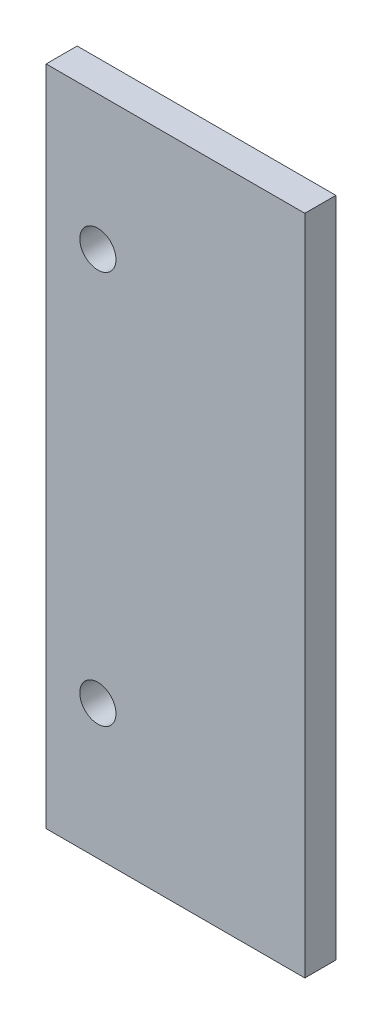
ISO-10303-21;
HEADER;
FILE_DESCRIPTION(('STEP AP214'),'2;1');
FILE_NAME('part.step','',(''),(''),'','','');
FILE_SCHEMA(('AUTOMOTIVE_DESIGN { 1 0 10303 214 1 1 1 1 }'));
ENDSEC;
DATA;
#1=APPLICATION_CONTEXT('core data for automotive mechanical design processes');
#2=APPLICATION_PROTOCOL_DEFINITION('international standard','automotive_design',2000,#1);
#3=PRODUCT_CONTEXT('',#1,'mechanical');
#4=PRODUCT('Part','Part','',(#3));
#5=PRODUCT_RELATED_PRODUCT_CATEGORY('part','',(#4));
#6=PRODUCT_DEFINITION_FORMATION('','',#4);
#7=PRODUCT_DEFINITION_CONTEXT('part definition',#1,'design');
#8=PRODUCT_DEFINITION('design','',#6,#7);
#9=PRODUCT_DEFINITION_SHAPE('','',#8);
#10=(LENGTH_UNIT() NAMED_UNIT(*) SI_UNIT(.MILLI.,.METRE.));
#11=(NAMED_UNIT(*) PLANE_ANGLE_UNIT() SI_UNIT($,.RADIAN.));
#12=(NAMED_UNIT(*) SI_UNIT($,.STERADIAN.) SOLID_ANGLE_UNIT());
#13=UNCERTAINTY_MEASURE_WITH_UNIT(LENGTH_MEASURE(1.E-05),#10,'distance_accuracy_value','');
#14=(GEOMETRIC_REPRESENTATION_CONTEXT(3) GLOBAL_UNCERTAINTY_ASSIGNED_CONTEXT((#13)) GLOBAL_UNIT_ASSIGNED_CONTEXT((#10,
#11,#12)) REPRESENTATION_CONTEXT('',''));
#15=CARTESIAN_POINT('',(0.,0.,0.));
#16=DIRECTION('',(0.,0.,1.));
#17=DIRECTION('',(1.,0.,0.));
#18=AXIS2_PLACEMENT_3D('',#15,#16,#17);
#19=CARTESIAN_POINT('',(0.,64.,3.));
#20=DIRECTION('',(0.,0.,-1.));
#21=DIRECTION('',(-1.,0.,0.));
#22=AXIS2_PLACEMENT_3D('',#19,#20,#21);
#23=PLANE('',#22);
#24=CARTESIAN_POINT('',(5.,51.,3.));
#25=DIRECTION('',(0.,0.,1.));
#26=DIRECTION('',(1.,0.,0.));
#27=AXIS2_PLACEMENT_3D('',#24,#25,#26);
#28=CIRCLE('',#27,1.75);
#29=CARTESIAN_POINT('',(6.75,51.,3.));
#30=VERTEX_POINT('',#29);
#31=EDGE_CURVE('E98',#30,#30,#28,.T.);
#32=ORIENTED_EDGE('',*,*,#31,.F.);
#33=EDGE_LOOP('',(#32));
#34=FACE_BOUND('',#33,.T.);
#35=DIRECTION('',(0.,-1.,0.));
#36=VECTOR('',#35,1.);
#37=CARTESIAN_POINT('',(0.,0.,3.));
#38=LINE('',#37,#36);
#39=CARTESIAN_POINT('',(0.,64.,3.));
#40=VERTEX_POINT('',#39);
#41=CARTESIAN_POINT('',(0.,0.,3.));
#42=VERTEX_POINT('',#41);
#43=EDGE_CURVE('E83',#40,#42,#38,.T.);
#44=ORIENTED_EDGE('',*,*,#43,.T.);
#45=DIRECTION('',(1.,0.,0.));
#46=VECTOR('',#45,1.);
#47=CARTESIAN_POINT('',(0.,0.,3.));
#48=LINE('',#47,#46);
#49=CARTESIAN_POINT('',(25.,0.,3.));
#50=VERTEX_POINT('',#49);
#51=EDGE_CURVE('E78',#42,#50,#48,.T.);
#52=ORIENTED_EDGE('',*,*,#51,.T.);
#53=DIRECTION('',(0.,1.,0.));
#54=VECTOR('',#53,1.);
#55=CARTESIAN_POINT('',(25.,0.,3.));
#56=LINE('',#55,#54);
#57=CARTESIAN_POINT('',(25.,64.,3.));
#58=VERTEX_POINT('',#57);
#59=EDGE_CURVE('E81',#50,#58,#56,.T.);
#60=ORIENTED_EDGE('',*,*,#59,.T.);
#61=DIRECTION('',(-1.,0.,0.));
#62=VECTOR('',#61,1.);
#63=CARTESIAN_POINT('',(0.,64.,3.));
#64=LINE('',#63,#62);
#65=EDGE_CURVE('E48',#58,#40,#64,.T.);
#66=ORIENTED_EDGE('',*,*,#65,.T.);
#67=EDGE_LOOP('',(#44,#52,#60,#66));
#68=FACE_BOUND('',#67,.T.);
#69=CARTESIAN_POINT('',(5.,13.,3.));
#70=DIRECTION('',(0.,0.,1.));
#71=DIRECTION('',(1.,0.,0.));
#72=AXIS2_PLACEMENT_3D('',#69,#70,#71);
#73=CIRCLE('',#72,1.75);
#74=CARTESIAN_POINT('',(6.75000000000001,13.,3.));
#75=VERTEX_POINT('',#74);
#76=EDGE_CURVE('E113',#75,#75,#73,.T.);
#77=ORIENTED_EDGE('',*,*,#76,.F.);
#78=EDGE_LOOP('',(#77));
#79=FACE_BOUND('',#78,.T.);
#80=ADVANCED_FACE('F31',(#34,#68,#79),#23,.F.);
#81=CARTESIAN_POINT('',(0.,64.,0.));
#82=DIRECTION('',(0.,0.,-1.));
#83=DIRECTION('',(-1.,0.,0.));
#84=AXIS2_PLACEMENT_3D('',#81,#82,#83);
#85=PLANE('',#84);
#86=CARTESIAN_POINT('',(5.,51.,0.));
#87=DIRECTION('',(0.,0.,1.));
#88=DIRECTION('',(1.,0.,0.));
#89=AXIS2_PLACEMENT_3D('',#86,#87,#88);
#90=CIRCLE('',#89,1.75);
#91=CARTESIAN_POINT('',(6.75,51.,0.));
#92=VERTEX_POINT('',#91);
#93=EDGE_CURVE('E110',#92,#92,#90,.T.);
#94=ORIENTED_EDGE('',*,*,#93,.T.);
#95=EDGE_LOOP('',(#94));
#96=FACE_BOUND('',#95,.T.);
#97=DIRECTION('',(0.,-1.,0.));
#98=VECTOR('',#97,1.);
#99=CARTESIAN_POINT('',(0.,0.,0.));
#100=LINE('',#99,#98);
#101=CARTESIAN_POINT('',(0.,64.,0.));
#102=VERTEX_POINT('',#101);
#103=CARTESIAN_POINT('',(0.,0.,0.));
#104=VERTEX_POINT('',#103);
#105=EDGE_CURVE('E95',#102,#104,#100,.T.);
#106=ORIENTED_EDGE('',*,*,#105,.F.);
#107=DIRECTION('',(-1.,0.,0.));
#108=VECTOR('',#107,1.);
#109=CARTESIAN_POINT('',(0.,64.,0.));
#110=LINE('',#109,#108);
#111=CARTESIAN_POINT('',(25.,64.,0.));
#112=VERTEX_POINT('',#111);
#113=EDGE_CURVE('E71',#112,#102,#110,.T.);
#114=ORIENTED_EDGE('',*,*,#113,.F.);
#115=DIRECTION('',(0.,1.,0.));
#116=VECTOR('',#115,1.);
#117=CARTESIAN_POINT('',(25.,0.,0.));
#118=LINE('',#117,#116);
#119=CARTESIAN_POINT('',(25.,0.,0.));
#120=VERTEX_POINT('',#119);
#121=EDGE_CURVE('E65',#120,#112,#118,.T.);
#122=ORIENTED_EDGE('',*,*,#121,.F.);
#123=DIRECTION('',(1.,0.,0.));
#124=VECTOR('',#123,1.);
#125=CARTESIAN_POINT('',(0.,0.,0.));
#126=LINE('',#125,#124);
#127=EDGE_CURVE('E87',#104,#120,#126,.T.);
#128=ORIENTED_EDGE('',*,*,#127,.F.);
#129=EDGE_LOOP('',(#106,#114,#122,#128));
#130=FACE_BOUND('',#129,.T.);
#131=CARTESIAN_POINT('',(5.,13.,0.));
#132=DIRECTION('',(0.,0.,1.));
#133=DIRECTION('',(1.,0.,0.));
#134=AXIS2_PLACEMENT_3D('',#131,#132,#133);
#135=CIRCLE('',#134,1.75);
#136=CARTESIAN_POINT('',(6.75000000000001,13.,0.));
#137=VERTEX_POINT('',#136);
#138=EDGE_CURVE('E116',#137,#137,#135,.T.);
#139=ORIENTED_EDGE('',*,*,#138,.T.);
#140=EDGE_LOOP('',(#139));
#141=FACE_BOUND('',#140,.T.);
#142=ADVANCED_FACE('F106',(#96,#130,#141),#85,.T.);
#143=CARTESIAN_POINT('',(0.,0.,3.));
#144=DIRECTION('',(1.,0.,0.));
#145=DIRECTION('',(0.,0.,-1.));
#146=AXIS2_PLACEMENT_3D('',#143,#144,#145);
#147=PLANE('',#146);
#148=ORIENTED_EDGE('',*,*,#105,.T.);
#149=DIRECTION('',(0.,0.,-1.));
#150=VECTOR('',#149,1.);
#151=CARTESIAN_POINT('',(0.,0.,3.));
#152=LINE('',#151,#150);
#153=EDGE_CURVE('E11',#42,#104,#152,.T.);
#154=ORIENTED_EDGE('',*,*,#153,.F.);
#155=ORIENTED_EDGE('',*,*,#43,.F.);
#156=DIRECTION('',(0.,0.,-1.));
#157=VECTOR('',#156,1.);
#158=CARTESIAN_POINT('',(0.,64.,3.));
#159=LINE('',#158,#157);
#160=EDGE_CURVE('E91',#40,#102,#159,.T.);
#161=ORIENTED_EDGE('',*,*,#160,.T.);
#162=EDGE_LOOP('',(#148,#154,#155,#161));
#163=FACE_BOUND('',#162,.T.);
#164=ADVANCED_FACE('F33',(#163),#147,.F.);
#165=CARTESIAN_POINT('',(0.,0.,3.));
#166=DIRECTION('',(0.,1.,0.));
#167=DIRECTION('',(0.,0.,1.));
#168=AXIS2_PLACEMENT_3D('',#165,#166,#167);
#169=PLANE('',#168);
#170=ORIENTED_EDGE('',*,*,#127,.T.);
#171=DIRECTION('',(0.,0.,-1.));
#172=VECTOR('',#171,1.);
#173=CARTESIAN_POINT('',(25.,0.,3.));
#174=LINE('',#173,#172);
#175=EDGE_CURVE('E40',#50,#120,#174,.T.);
#176=ORIENTED_EDGE('',*,*,#175,.F.);
#177=ORIENTED_EDGE('',*,*,#51,.F.);
#178=ORIENTED_EDGE('',*,*,#153,.T.);
#179=EDGE_LOOP('',(#170,#176,#177,#178));
#180=FACE_BOUND('',#179,.T.);
#181=ADVANCED_FACE('F86',(#180),#169,.F.);
#182=CARTESIAN_POINT('',(25.,0.,3.));
#183=DIRECTION('',(-1.,0.,0.));
#184=DIRECTION('',(0.,-1.,0.));
#185=AXIS2_PLACEMENT_3D('',#182,#183,#184);
#186=PLANE('',#185);
#187=ORIENTED_EDGE('',*,*,#121,.T.);
#188=DIRECTION('',(0.,0.,-1.));
#189=VECTOR('',#188,1.);
#190=CARTESIAN_POINT('',(25.,64.,3.));
#191=LINE('',#190,#189);
#192=EDGE_CURVE('E88',#58,#112,#191,.T.);
#193=ORIENTED_EDGE('',*,*,#192,.F.);
#194=ORIENTED_EDGE('',*,*,#59,.F.);
#195=ORIENTED_EDGE('',*,*,#175,.T.);
#196=EDGE_LOOP('',(#187,#193,#194,#195));
#197=FACE_BOUND('',#196,.T.);
#198=ADVANCED_FACE('F89',(#197),#186,.F.);
#199=CARTESIAN_POINT('',(0.,64.,3.));
#200=DIRECTION('',(0.,-1.,0.));
#201=DIRECTION('',(0.,0.,-1.));
#202=AXIS2_PLACEMENT_3D('',#199,#200,#201);
#203=PLANE('',#202);
#204=ORIENTED_EDGE('',*,*,#113,.T.);
#205=ORIENTED_EDGE('',*,*,#160,.F.);
#206=ORIENTED_EDGE('',*,*,#65,.F.);
#207=ORIENTED_EDGE('',*,*,#192,.T.);
#208=EDGE_LOOP('',(#204,#205,#206,#207));
#209=FACE_BOUND('',#208,.T.);
#210=ADVANCED_FACE('F103',(#209),#203,.F.);
#211=CARTESIAN_POINT('',(5.,51.,3.));
#212=DIRECTION('',(0.,0.,-1.));
#213=DIRECTION('',(-1.,0.,0.));
#214=AXIS2_PLACEMENT_3D('',#211,#212,#213);
#215=CYLINDRICAL_SURFACE('',#214,1.75);
#216=ORIENTED_EDGE('',*,*,#31,.T.);
#217=EDGE_LOOP('',(#216));
#218=FACE_BOUND('',#217,.T.);
#219=ORIENTED_EDGE('',*,*,#93,.F.);
#220=EDGE_LOOP('',(#219));
#221=FACE_BOUND('',#220,.T.);
#222=ADVANCED_FACE('F134',(#218,#221),#215,.F.);
#223=CARTESIAN_POINT('',(5.,13.,3.));
#224=DIRECTION('',(0.,0.,-1.));
#225=DIRECTION('',(-1.,0.,0.));
#226=AXIS2_PLACEMENT_3D('',#223,#224,#225);
#227=CYLINDRICAL_SURFACE('',#226,1.75);
#228=ORIENTED_EDGE('',*,*,#76,.T.);
#229=EDGE_LOOP('',(#228));
#230=FACE_BOUND('',#229,.T.);
#231=ORIENTED_EDGE('',*,*,#138,.F.);
#232=EDGE_LOOP('',(#231));
#233=FACE_BOUND('',#232,.T.);
#234=ADVANCED_FACE('F122',(#230,#233),#227,.F.);
#235=CLOSED_SHELL('',(#80,#142,#164,#181,#198,#210,#222,#234));
#236=MANIFOLD_SOLID_BREP('B2',#235);
#237=ADVANCED_BREP_SHAPE_REPRESENTATION('',(#18,#236),#14);
#238=SHAPE_DEFINITION_REPRESENTATION(#9,#237);
ENDSEC;
END-ISO-10303-21;
